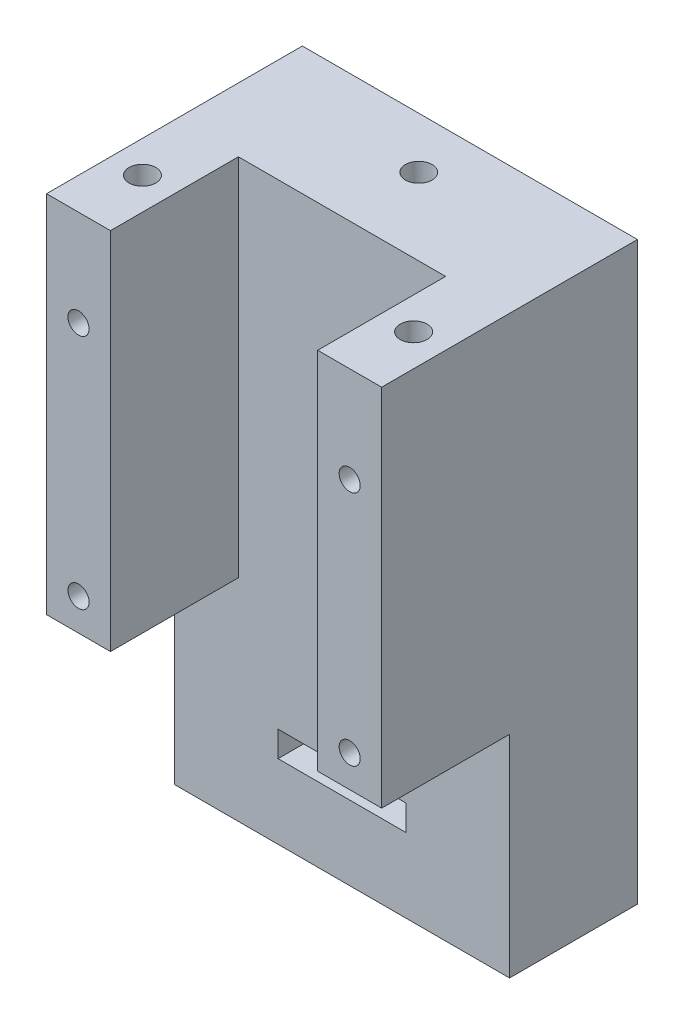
from build123d import *

# Parameters (mm, degrees)
SKETCH_1_W          = 52.4
SKETCH_1_H          = 90
SKETCH_1_W_2        = 20
SKETCH_1_H_2        = 4
EXTRUDE_1_DEPTH     = 40
SKETCH_2_OUTSIDE_W  = 64.312
SKETCH_2_OUTSIDE_H  = 114.312
CUT_EXTRUDE_1_DEPTH = 112.56056651
SKETCH_3_R          = 1.65
CUT_EXTRUDE_2_DEPTH = 15
SKETCH_4_OUTSIDE_W  = 76.712
SKETCH_4_OUTSIDE_H  = 64.312
CUT_EXTRUDE_3_DEPTH = 112.56056651
SKETCH_5_R          = 2.1
CUT_EXTRUDE_4_DEPTH = 15
SKETCH_7_R          = 2.5
CUT_EXTRUDE_5_DEPTH = 15


with BuildPart() as part:
    # Sketch 1 → Extrude 1 (new body)
    with BuildSketch(Plane.XY):
        with Locations((26.2, 45)):
            Rectangle(SKETCH_1_W, SKETCH_1_H)
        with Locations((26.2, 13.6)):
            Rectangle(SKETCH_1_W_2, SKETCH_1_H_2, mode=Mode.SUBTRACT)
    extrude(amount=EXTRUDE_1_DEPTH)

    # Sketch 2 outside → Cut-Extrude 1 (cut, through all)
    with BuildSketch(Plane(origin=(52.4, 0, 0), x_dir=(0, 0, -1), z_dir=(1, 0, 0))):
        with Locations((-20, 45)):
            Rectangle(SKETCH_2_OUTSIDE_W, SKETCH_2_OUTSIDE_H)
        Polygon((-40, 90), (0, 90), (0, 0), (-20, 0), (-20, 33), (-40, 33), align=None, mode=Mode.SUBTRACT)
    extrude(amount=-CUT_EXTRUDE_1_DEPTH, mode=Mode.SUBTRACT)

    # Sketch 3 → Cut-Extrude 2 (cut)
    with BuildSketch(Plane.XY.offset(40)):
        with Locations((5, 75)):
            Circle(SKETCH_3_R)
        with Locations((47.4, 75)):
            Circle(SKETCH_3_R)
        with Locations((47.4, 38)):
            Circle(SKETCH_3_R)
        with Locations((5, 38)):
            Circle(SKETCH_3_R)
    extrude(amount=-CUT_EXTRUDE_2_DEPTH, mode=Mode.SUBTRACT)

    # Sketch 4 outside → Cut-Extrude 3 (cut, through all)
    with BuildSketch(Plane(origin=(0, 90, 0), x_dir=(1, 0, 0), z_dir=(0, 1, 0))):
        with Locations((26.2, -20)):
            Rectangle(SKETCH_4_OUTSIDE_W, SKETCH_4_OUTSIDE_H)
        Polygon((10, -40), (10, -20), (42.4, -20), (42.4, -40), (52.4, -40), (52.4, 0), (0, 0), (0, -40), align=None, mode=Mode.SUBTRACT)
    extrude(amount=-CUT_EXTRUDE_3_DEPTH, mode=Mode.SUBTRACT)

    # Sketch 5 → Cut-Extrude 4 (cut)
    with BuildSketch(Plane(origin=(0, 90, 0), x_dir=(1, 0, 0), z_dir=(0, 1, 0))):
        with Locations(Location((26.2, -8, 0), (0, 0, 270))):
            Circle(SKETCH_5_R)
        with Locations(Location((5, -30, 0), (0, 0, 270))):
            Circle(SKETCH_5_R)
        with Locations(Location((47.4, -30, 0), (0, 0, 270))):
            Circle(SKETCH_5_R)
    extrude(amount=-CUT_EXTRUDE_4_DEPTH, mode=Mode.SUBTRACT)

    # Sketch 7 → Cut-Extrude 5 (cut)
    with BuildSketch(Plane.XZ):
        with Locations(Location((8, 10, 0), (0, 0, 270))):
            Circle(SKETCH_7_R)
        with Locations(Location((44.4, 10, 0), (0, 0, 270))):
            Circle(SKETCH_7_R)
    extrude(amount=-CUT_EXTRUDE_5_DEPTH, mode=Mode.SUBTRACT)


solid = part.part
